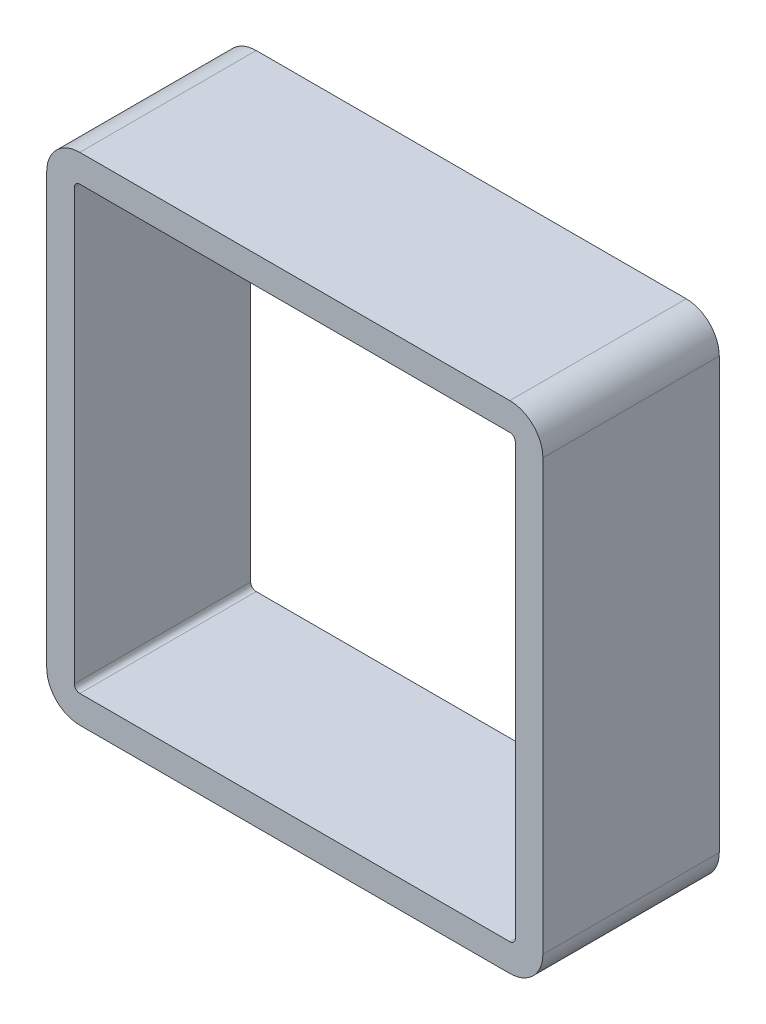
ISO-10303-21;
HEADER;
FILE_DESCRIPTION(('STEP AP214'),'2;1');
FILE_NAME('part.step','',(''),(''),'','','');
FILE_SCHEMA(('AUTOMOTIVE_DESIGN { 1 0 10303 214 1 1 1 1 }'));
ENDSEC;
DATA;
#1=APPLICATION_CONTEXT('core data for automotive mechanical design processes');
#2=APPLICATION_PROTOCOL_DEFINITION('international standard','automotive_design',2000,#1);
#3=PRODUCT_CONTEXT('',#1,'mechanical');
#4=PRODUCT('Part','Part','',(#3));
#5=PRODUCT_RELATED_PRODUCT_CATEGORY('part','',(#4));
#6=PRODUCT_DEFINITION_FORMATION('','',#4);
#7=PRODUCT_DEFINITION_CONTEXT('part definition',#1,'design');
#8=PRODUCT_DEFINITION('design','',#6,#7);
#9=PRODUCT_DEFINITION_SHAPE('','',#8);
#10=(LENGTH_UNIT() NAMED_UNIT(*) SI_UNIT(.MILLI.,.METRE.));
#11=(NAMED_UNIT(*) PLANE_ANGLE_UNIT() SI_UNIT($,.RADIAN.));
#12=(NAMED_UNIT(*) SI_UNIT($,.STERADIAN.) SOLID_ANGLE_UNIT());
#13=UNCERTAINTY_MEASURE_WITH_UNIT(LENGTH_MEASURE(1.E-05),#10,'distance_accuracy_value','');
#14=(GEOMETRIC_REPRESENTATION_CONTEXT(3) GLOBAL_UNCERTAINTY_ASSIGNED_CONTEXT((#13)) GLOBAL_UNIT_ASSIGNED_CONTEXT((#10,
#11,#12)) REPRESENTATION_CONTEXT('',''));
#15=CARTESIAN_POINT('',(0.,0.,0.));
#16=DIRECTION('',(0.,0.,1.));
#17=DIRECTION('',(1.,0.,0.));
#18=AXIS2_PLACEMENT_3D('',#15,#16,#17);
#19=CARTESIAN_POINT('',(17.9625162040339,-9.91931366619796,0.));
#20=DIRECTION('',(0.,0.,1.));
#21=DIRECTION('',(1.,0.,0.));
#22=AXIS2_PLACEMENT_3D('',#19,#20,#21);
#23=CYLINDRICAL_SURFACE('',#22,0.500000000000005);
#24=DIRECTION('',(0.,0.,-1.));
#25=VECTOR('',#24,1.);
#26=CARTESIAN_POINT('',(18.4625162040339,-9.91931366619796,0.));
#27=LINE('',#26,#25);
#28=CARTESIAN_POINT('',(18.4625162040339,-9.91931366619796,16.));
#29=VERTEX_POINT('',#28);
#30=CARTESIAN_POINT('',(18.4625162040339,-9.91931366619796,0.));
#31=VERTEX_POINT('',#30);
#32=EDGE_CURVE('E140',#29,#31,#27,.T.);
#33=ORIENTED_EDGE('',*,*,#32,.T.);
#34=CARTESIAN_POINT('',(17.9625162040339,-9.91931366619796,0.));
#35=DIRECTION('',(0.,0.,1.));
#36=DIRECTION('',(1.,0.,0.));
#37=AXIS2_PLACEMENT_3D('',#34,#35,#36);
#38=CIRCLE('',#37,0.500000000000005);
#39=CARTESIAN_POINT('',(17.9625162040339,-10.419313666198,0.));
#40=VERTEX_POINT('',#39);
#41=EDGE_CURVE('E19',#40,#31,#38,.T.);
#42=ORIENTED_EDGE('',*,*,#41,.F.);
#43=DIRECTION('',(0.,0.,-1.));
#44=VECTOR('',#43,1.);
#45=CARTESIAN_POINT('',(17.9625162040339,-10.419313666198,0.));
#46=LINE('',#45,#44);
#47=CARTESIAN_POINT('',(17.9625162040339,-10.419313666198,16.));
#48=VERTEX_POINT('',#47);
#49=EDGE_CURVE('E180',#40,#48,#46,.F.);
#50=ORIENTED_EDGE('',*,*,#49,.T.);
#51=CARTESIAN_POINT('',(17.9625162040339,-9.91931366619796,16.));
#52=DIRECTION('',(0.,0.,1.));
#53=DIRECTION('',(1.,0.,0.));
#54=AXIS2_PLACEMENT_3D('',#51,#52,#53);
#55=CIRCLE('',#54,0.500000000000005);
#56=EDGE_CURVE('E138',#29,#48,#55,.F.);
#57=ORIENTED_EDGE('',*,*,#56,.F.);
#58=EDGE_LOOP('',(#33,#42,#50,#57));
#59=FACE_BOUND('',#58,.T.);
#60=ADVANCED_FACE('F16',(#59),#23,.F.);
#61=CARTESIAN_POINT('',(-21.0374837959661,-9.91931366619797,0.));
#62=DIRECTION('',(0.,0.,1.));
#63=DIRECTION('',(1.,0.,0.));
#64=AXIS2_PLACEMENT_3D('',#61,#62,#63);
#65=CYLINDRICAL_SURFACE('',#64,0.499999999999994);
#66=DIRECTION('',(0.,0.,-1.));
#67=VECTOR('',#66,1.);
#68=CARTESIAN_POINT('',(-21.0374837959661,-10.419313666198,0.));
#69=LINE('',#68,#67);
#70=CARTESIAN_POINT('',(-21.0374837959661,-10.419313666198,16.));
#71=VERTEX_POINT('',#70);
#72=CARTESIAN_POINT('',(-21.0374837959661,-10.419313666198,0.));
#73=VERTEX_POINT('',#72);
#74=EDGE_CURVE('E144',#71,#73,#69,.T.);
#75=ORIENTED_EDGE('',*,*,#74,.T.);
#76=CARTESIAN_POINT('',(-21.0374837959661,-9.91931366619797,0.));
#77=DIRECTION('',(0.,0.,1.));
#78=DIRECTION('',(1.,0.,0.));
#79=AXIS2_PLACEMENT_3D('',#76,#77,#78);
#80=CIRCLE('',#79,0.499999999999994);
#81=CARTESIAN_POINT('',(-21.5374837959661,-9.91931366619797,0.));
#82=VERTEX_POINT('',#81);
#83=EDGE_CURVE('E230',#82,#73,#80,.T.);
#84=ORIENTED_EDGE('',*,*,#83,.F.);
#85=DIRECTION('',(0.,0.,1.));
#86=VECTOR('',#85,1.);
#87=CARTESIAN_POINT('',(-21.5374837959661,-9.91931366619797,0.));
#88=LINE('',#87,#86);
#89=CARTESIAN_POINT('',(-21.5374837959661,-9.91931366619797,16.));
#90=VERTEX_POINT('',#89);
#91=EDGE_CURVE('E177',#82,#90,#88,.T.);
#92=ORIENTED_EDGE('',*,*,#91,.T.);
#93=CARTESIAN_POINT('',(-21.0374837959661,-9.91931366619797,16.));
#94=DIRECTION('',(0.,0.,1.));
#95=DIRECTION('',(1.,0.,0.));
#96=AXIS2_PLACEMENT_3D('',#93,#94,#95);
#97=CIRCLE('',#96,0.499999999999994);
#98=EDGE_CURVE('E200',#71,#90,#97,.F.);
#99=ORIENTED_EDGE('',*,*,#98,.F.);
#100=EDGE_LOOP('',(#75,#84,#92,#99));
#101=FACE_BOUND('',#100,.T.);
#102=ADVANCED_FACE('F384',(#101),#65,.F.);
#103=CARTESIAN_POINT('',(-21.0374837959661,32.080686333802,0.));
#104=DIRECTION('',(0.,1.,0.));
#105=DIRECTION('',(0.,0.,1.));
#106=AXIS2_PLACEMENT_3D('',#103,#104,#105);
#107=PLANE('',#106);
#108=DIRECTION('',(1.,0.,0.));
#109=VECTOR('',#108,1.);
#110=CARTESIAN_POINT('',(-1.5374837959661,32.080686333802,0.));
#111=LINE('',#110,#109);
#112=CARTESIAN_POINT('',(17.9625162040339,32.080686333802,0.));
#113=VERTEX_POINT('',#112);
#114=CARTESIAN_POINT('',(-21.0374837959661,32.080686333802,0.));
#115=VERTEX_POINT('',#114);
#116=EDGE_CURVE('E157',#113,#115,#111,.F.);
#117=ORIENTED_EDGE('',*,*,#116,.T.);
#118=DIRECTION('',(0.,0.,1.));
#119=VECTOR('',#118,1.);
#120=CARTESIAN_POINT('',(-21.0374837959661,32.080686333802,0.));
#121=LINE('',#120,#119);
#122=CARTESIAN_POINT('',(-21.0374837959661,32.080686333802,16.));
#123=VERTEX_POINT('',#122);
#124=EDGE_CURVE('E198',#123,#115,#121,.F.);
#125=ORIENTED_EDGE('',*,*,#124,.F.);
#126=DIRECTION('',(1.,0.,0.));
#127=VECTOR('',#126,1.);
#128=CARTESIAN_POINT('',(-1.5374837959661,32.080686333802,16.));
#129=LINE('',#128,#127);
#130=CARTESIAN_POINT('',(17.9625162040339,32.080686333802,16.));
#131=VERTEX_POINT('',#130);
#132=EDGE_CURVE('E175',#131,#123,#129,.F.);
#133=ORIENTED_EDGE('',*,*,#132,.F.);
#134=DIRECTION('',(0.,0.,1.));
#135=VECTOR('',#134,1.);
#136=CARTESIAN_POINT('',(17.9625162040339,32.080686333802,0.));
#137=LINE('',#136,#135);
#138=EDGE_CURVE('E145',#113,#131,#137,.T.);
#139=ORIENTED_EDGE('',*,*,#138,.F.);
#140=EDGE_LOOP('',(#117,#125,#133,#139));
#141=FACE_BOUND('',#140,.T.);
#142=ADVANCED_FACE('F376',(#141),#107,.T.);
#143=CARTESIAN_POINT('',(-21.0374837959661,29.080686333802,0.));
#144=DIRECTION('',(0.,0.,1.));
#145=DIRECTION('',(1.,0.,0.));
#146=AXIS2_PLACEMENT_3D('',#143,#144,#145);
#147=CYLINDRICAL_SURFACE('',#146,3.);
#148=CARTESIAN_POINT('',(-21.0374837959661,29.080686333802,0.));
#149=DIRECTION('',(0.,0.,1.));
#150=DIRECTION('',(1.,0.,0.));
#151=AXIS2_PLACEMENT_3D('',#148,#149,#150);
#152=CIRCLE('',#151,3.);
#153=CARTESIAN_POINT('',(-24.0374837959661,29.080686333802,0.));
#154=VERTEX_POINT('',#153);
#155=EDGE_CURVE('E153',#115,#154,#152,.T.);
#156=ORIENTED_EDGE('',*,*,#155,.T.);
#157=DIRECTION('',(0.,0.,1.));
#158=VECTOR('',#157,1.);
#159=CARTESIAN_POINT('',(-24.0374837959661,29.080686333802,0.));
#160=LINE('',#159,#158);
#161=CARTESIAN_POINT('',(-24.0374837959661,29.080686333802,16.));
#162=VERTEX_POINT('',#161);
#163=EDGE_CURVE('E196',#162,#154,#160,.F.);
#164=ORIENTED_EDGE('',*,*,#163,.F.);
#165=CARTESIAN_POINT('',(-21.0374837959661,29.080686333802,16.));
#166=DIRECTION('',(0.,0.,1.));
#167=DIRECTION('',(1.,0.,0.));
#168=AXIS2_PLACEMENT_3D('',#165,#166,#167);
#169=CIRCLE('',#168,3.);
#170=EDGE_CURVE('E218',#123,#162,#169,.T.);
#171=ORIENTED_EDGE('',*,*,#170,.F.);
#172=ORIENTED_EDGE('',*,*,#124,.T.);
#173=EDGE_LOOP('',(#156,#164,#171,#172));
#174=FACE_BOUND('',#173,.T.);
#175=ADVANCED_FACE('F368',(#174),#147,.T.);
#176=CARTESIAN_POINT('',(-24.0374837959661,-9.91931366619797,0.));
#177=DIRECTION('',(-1.,0.,0.));
#178=DIRECTION('',(0.,0.,1.));
#179=AXIS2_PLACEMENT_3D('',#176,#177,#178);
#180=PLANE('',#179);
#181=DIRECTION('',(0.,1.,0.));
#182=VECTOR('',#181,1.);
#183=CARTESIAN_POINT('',(-24.0374837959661,9.58068633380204,0.));
#184=LINE('',#183,#182);
#185=CARTESIAN_POINT('',(-24.0374837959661,-9.91931366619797,0.));
#186=VERTEX_POINT('',#185);
#187=EDGE_CURVE('E169',#154,#186,#184,.F.);
#188=ORIENTED_EDGE('',*,*,#187,.T.);
#189=DIRECTION('',(0.,0.,1.));
#190=VECTOR('',#189,1.);
#191=CARTESIAN_POINT('',(-24.0374837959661,-9.91931366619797,0.));
#192=LINE('',#191,#190);
#193=CARTESIAN_POINT('',(-24.0374837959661,-9.91931366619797,16.));
#194=VERTEX_POINT('',#193);
#195=EDGE_CURVE('E194',#194,#186,#192,.F.);
#196=ORIENTED_EDGE('',*,*,#195,.F.);
#197=DIRECTION('',(0.,1.,0.));
#198=VECTOR('',#197,1.);
#199=CARTESIAN_POINT('',(-24.0374837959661,9.58068633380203,16.));
#200=LINE('',#199,#198);
#201=EDGE_CURVE('E217',#162,#194,#200,.F.);
#202=ORIENTED_EDGE('',*,*,#201,.F.);
#203=ORIENTED_EDGE('',*,*,#163,.T.);
#204=EDGE_LOOP('',(#188,#196,#202,#203));
#205=FACE_BOUND('',#204,.T.);
#206=ADVANCED_FACE('F360',(#205),#180,.T.);
#207=CARTESIAN_POINT('',(-21.0374837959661,-9.91931366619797,0.));
#208=DIRECTION('',(0.,0.,1.));
#209=DIRECTION('',(1.,0.,0.));
#210=AXIS2_PLACEMENT_3D('',#207,#208,#209);
#211=CYLINDRICAL_SURFACE('',#210,3.);
#212=CARTESIAN_POINT('',(-21.0374837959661,-9.91931366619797,0.));
#213=DIRECTION('',(0.,0.,1.));
#214=DIRECTION('',(1.,0.,0.));
#215=AXIS2_PLACEMENT_3D('',#212,#213,#214);
#216=CIRCLE('',#215,3.);
#217=CARTESIAN_POINT('',(-21.0374837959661,-12.919313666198,0.));
#218=VERTEX_POINT('',#217);
#219=EDGE_CURVE('E168',#186,#218,#216,.T.);
#220=ORIENTED_EDGE('',*,*,#219,.T.);
#221=DIRECTION('',(0.,0.,-1.));
#222=VECTOR('',#221,1.);
#223=CARTESIAN_POINT('',(-21.0374837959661,-12.919313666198,0.));
#224=LINE('',#223,#222);
#225=CARTESIAN_POINT('',(-21.0374837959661,-12.919313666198,16.));
#226=VERTEX_POINT('',#225);
#227=EDGE_CURVE('E192',#226,#218,#224,.T.);
#228=ORIENTED_EDGE('',*,*,#227,.F.);
#229=CARTESIAN_POINT('',(-21.0374837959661,-9.91931366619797,16.));
#230=DIRECTION('',(0.,0.,1.));
#231=DIRECTION('',(1.,0.,0.));
#232=AXIS2_PLACEMENT_3D('',#229,#230,#231);
#233=CIRCLE('',#232,3.);
#234=EDGE_CURVE('E215',#194,#226,#233,.T.);
#235=ORIENTED_EDGE('',*,*,#234,.F.);
#236=ORIENTED_EDGE('',*,*,#195,.T.);
#237=EDGE_LOOP('',(#220,#228,#235,#236));
#238=FACE_BOUND('',#237,.T.);
#239=ADVANCED_FACE('F352',(#238),#211,.T.);
#240=CARTESIAN_POINT('',(17.9625162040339,-12.919313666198,0.));
#241=DIRECTION('',(0.,-1.,0.));
#242=DIRECTION('',(0.,0.,-1.));
#243=AXIS2_PLACEMENT_3D('',#240,#241,#242);
#244=PLANE('',#243);
#245=DIRECTION('',(1.,0.,0.));
#246=VECTOR('',#245,1.);
#247=CARTESIAN_POINT('',(-1.5374837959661,-12.919313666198,0.));
#248=LINE('',#247,#246);
#249=CARTESIAN_POINT('',(17.9625162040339,-12.919313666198,0.));
#250=VERTEX_POINT('',#249);
#251=EDGE_CURVE('E165',#218,#250,#248,.T.);
#252=ORIENTED_EDGE('',*,*,#251,.T.);
#253=DIRECTION('',(0.,0.,1.));
#254=VECTOR('',#253,1.);
#255=CARTESIAN_POINT('',(17.9625162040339,-12.919313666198,0.));
#256=LINE('',#255,#254);
#257=CARTESIAN_POINT('',(17.9625162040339,-12.919313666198,16.));
#258=VERTEX_POINT('',#257);
#259=EDGE_CURVE('E190',#258,#250,#256,.F.);
#260=ORIENTED_EDGE('',*,*,#259,.F.);
#261=DIRECTION('',(1.,0.,0.));
#262=VECTOR('',#261,1.);
#263=CARTESIAN_POINT('',(-1.5374837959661,-12.919313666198,16.));
#264=LINE('',#263,#262);
#265=EDGE_CURVE('E214',#226,#258,#264,.T.);
#266=ORIENTED_EDGE('',*,*,#265,.F.);
#267=ORIENTED_EDGE('',*,*,#227,.T.);
#268=EDGE_LOOP('',(#252,#260,#266,#267));
#269=FACE_BOUND('',#268,.T.);
#270=ADVANCED_FACE('F344',(#269),#244,.T.);
#271=CARTESIAN_POINT('',(17.9625162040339,-9.91931366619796,0.));
#272=DIRECTION('',(0.,0.,1.));
#273=DIRECTION('',(1.,0.,0.));
#274=AXIS2_PLACEMENT_3D('',#271,#272,#273);
#275=CYLINDRICAL_SURFACE('',#274,3.);
#276=CARTESIAN_POINT('',(17.9625162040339,-9.91931366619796,0.));
#277=DIRECTION('',(0.,0.,1.));
#278=DIRECTION('',(1.,0.,0.));
#279=AXIS2_PLACEMENT_3D('',#276,#277,#278);
#280=CIRCLE('',#279,3.);
#281=CARTESIAN_POINT('',(20.9625162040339,-9.91931366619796,0.));
#282=VERTEX_POINT('',#281);
#283=EDGE_CURVE('E164',#250,#282,#280,.T.);
#284=ORIENTED_EDGE('',*,*,#283,.T.);
#285=DIRECTION('',(0.,0.,-1.));
#286=VECTOR('',#285,1.);
#287=CARTESIAN_POINT('',(20.9625162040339,-9.91931366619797,0.));
#288=LINE('',#287,#286);
#289=CARTESIAN_POINT('',(20.9625162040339,-9.91931366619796,16.));
#290=VERTEX_POINT('',#289);
#291=EDGE_CURVE('E188',#290,#282,#288,.T.);
#292=ORIENTED_EDGE('',*,*,#291,.F.);
#293=CARTESIAN_POINT('',(17.9625162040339,-9.91931366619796,16.));
#294=DIRECTION('',(0.,0.,1.));
#295=DIRECTION('',(1.,0.,0.));
#296=AXIS2_PLACEMENT_3D('',#293,#294,#295);
#297=CIRCLE('',#296,3.);
#298=EDGE_CURVE('E212',#258,#290,#297,.T.);
#299=ORIENTED_EDGE('',*,*,#298,.F.);
#300=ORIENTED_EDGE('',*,*,#259,.T.);
#301=EDGE_LOOP('',(#284,#292,#299,#300));
#302=FACE_BOUND('',#301,.T.);
#303=ADVANCED_FACE('F336',(#302),#275,.T.);
#304=CARTESIAN_POINT('',(20.9625162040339,29.080686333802,0.));
#305=DIRECTION('',(1.,0.,0.));
#306=DIRECTION('',(0.,0.,-1.));
#307=AXIS2_PLACEMENT_3D('',#304,#305,#306);
#308=PLANE('',#307);
#309=DIRECTION('',(0.,1.,0.));
#310=VECTOR('',#309,1.);
#311=CARTESIAN_POINT('',(20.9625162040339,9.58068633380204,0.));
#312=LINE('',#311,#310);
#313=CARTESIAN_POINT('',(20.9625162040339,29.080686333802,0.));
#314=VERTEX_POINT('',#313);
#315=EDGE_CURVE('E161',#282,#314,#312,.T.);
#316=ORIENTED_EDGE('',*,*,#315,.T.);
#317=DIRECTION('',(0.,0.,1.));
#318=VECTOR('',#317,1.);
#319=CARTESIAN_POINT('',(20.9625162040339,29.080686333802,0.));
#320=LINE('',#319,#318);
#321=CARTESIAN_POINT('',(20.9625162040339,29.080686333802,16.));
#322=VERTEX_POINT('',#321);
#323=EDGE_CURVE('E186',#322,#314,#320,.F.);
#324=ORIENTED_EDGE('',*,*,#323,.F.);
#325=DIRECTION('',(0.,1.,0.));
#326=VECTOR('',#325,1.);
#327=CARTESIAN_POINT('',(20.9625162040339,9.58068633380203,16.));
#328=LINE('',#327,#326);
#329=EDGE_CURVE('E211',#290,#322,#328,.T.);
#330=ORIENTED_EDGE('',*,*,#329,.F.);
#331=ORIENTED_EDGE('',*,*,#291,.T.);
#332=EDGE_LOOP('',(#316,#324,#330,#331));
#333=FACE_BOUND('',#332,.T.);
#334=ADVANCED_FACE('F328',(#333),#308,.T.);
#335=CARTESIAN_POINT('',(17.9625162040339,29.080686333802,0.));
#336=DIRECTION('',(0.,0.,1.));
#337=DIRECTION('',(1.,0.,0.));
#338=AXIS2_PLACEMENT_3D('',#335,#336,#337);
#339=CYLINDRICAL_SURFACE('',#338,3.);
#340=CARTESIAN_POINT('',(17.9625162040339,29.080686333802,0.));
#341=DIRECTION('',(0.,0.,1.));
#342=DIRECTION('',(1.,0.,0.));
#343=AXIS2_PLACEMENT_3D('',#340,#341,#342);
#344=CIRCLE('',#343,3.);
#345=EDGE_CURVE('E160',#314,#113,#344,.T.);
#346=ORIENTED_EDGE('',*,*,#345,.T.);
#347=ORIENTED_EDGE('',*,*,#138,.T.);
#348=CARTESIAN_POINT('',(17.9625162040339,29.080686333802,16.));
#349=DIRECTION('',(0.,0.,1.));
#350=DIRECTION('',(1.,0.,0.));
#351=AXIS2_PLACEMENT_3D('',#348,#349,#350);
#352=CIRCLE('',#351,3.);
#353=EDGE_CURVE('E208',#322,#131,#352,.T.);
#354=ORIENTED_EDGE('',*,*,#353,.F.);
#355=ORIENTED_EDGE('',*,*,#323,.T.);
#356=EDGE_LOOP('',(#346,#347,#354,#355));
#357=FACE_BOUND('',#356,.T.);
#358=ADVANCED_FACE('F321',(#357),#339,.T.);
#359=CARTESIAN_POINT('',(18.4625162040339,29.080686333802,0.));
#360=DIRECTION('',(1.,0.,0.));
#361=DIRECTION('',(0.,0.,-1.));
#362=AXIS2_PLACEMENT_3D('',#359,#360,#361);
#363=PLANE('',#362);
#364=DIRECTION('',(0.,0.,1.));
#365=VECTOR('',#364,1.);
#366=CARTESIAN_POINT('',(18.4625162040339,29.080686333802,0.));
#367=LINE('',#366,#365);
#368=CARTESIAN_POINT('',(18.4625162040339,29.080686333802,16.));
#369=VERTEX_POINT('',#368);
#370=CARTESIAN_POINT('',(18.4625162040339,29.080686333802,0.));
#371=VERTEX_POINT('',#370);
#372=EDGE_CURVE('E148',#369,#371,#367,.F.);
#373=ORIENTED_EDGE('',*,*,#372,.T.);
#374=DIRECTION('',(0.,1.,0.));
#375=VECTOR('',#374,1.);
#376=CARTESIAN_POINT('',(18.4625162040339,9.58068633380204,0.));
#377=LINE('',#376,#375);
#378=EDGE_CURVE('E134',#371,#31,#377,.F.);
#379=ORIENTED_EDGE('',*,*,#378,.T.);
#380=ORIENTED_EDGE('',*,*,#32,.F.);
#381=DIRECTION('',(0.,1.,0.));
#382=VECTOR('',#381,1.);
#383=CARTESIAN_POINT('',(18.4625162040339,9.58068633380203,16.));
#384=LINE('',#383,#382);
#385=EDGE_CURVE('E207',#369,#29,#384,.F.);
#386=ORIENTED_EDGE('',*,*,#385,.F.);
#387=EDGE_LOOP('',(#373,#379,#380,#386));
#388=FACE_BOUND('',#387,.T.);
#389=ADVANCED_FACE('F147',(#388),#363,.F.);
#390=CARTESIAN_POINT('',(17.9625162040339,-10.419313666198,0.));
#391=DIRECTION('',(0.,-1.,0.));
#392=DIRECTION('',(0.,0.,-1.));
#393=AXIS2_PLACEMENT_3D('',#390,#391,#392);
#394=PLANE('',#393);
#395=ORIENTED_EDGE('',*,*,#49,.F.);
#396=DIRECTION('',(1.,0.,0.));
#397=VECTOR('',#396,1.);
#398=CARTESIAN_POINT('',(-1.5374837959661,-10.419313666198,0.));
#399=LINE('',#398,#397);
#400=EDGE_CURVE('E137',#40,#73,#399,.F.);
#401=ORIENTED_EDGE('',*,*,#400,.T.);
#402=ORIENTED_EDGE('',*,*,#74,.F.);
#403=DIRECTION('',(1.,0.,0.));
#404=VECTOR('',#403,1.);
#405=CARTESIAN_POINT('',(-1.5374837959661,-10.419313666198,16.));
#406=LINE('',#405,#404);
#407=EDGE_CURVE('E235',#48,#71,#406,.F.);
#408=ORIENTED_EDGE('',*,*,#407,.F.);
#409=EDGE_LOOP('',(#395,#401,#402,#408));
#410=FACE_BOUND('',#409,.T.);
#411=ADVANCED_FACE('F238',(#410),#394,.F.);
#412=CARTESIAN_POINT('',(-21.5374837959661,-9.91931366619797,0.));
#413=DIRECTION('',(-1.,0.,0.));
#414=DIRECTION('',(0.,0.,1.));
#415=AXIS2_PLACEMENT_3D('',#412,#413,#414);
#416=PLANE('',#415);
#417=ORIENTED_EDGE('',*,*,#91,.F.);
#418=DIRECTION('',(0.,1.,0.));
#419=VECTOR('',#418,1.);
#420=CARTESIAN_POINT('',(-21.5374837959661,9.58068633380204,0.));
#421=LINE('',#420,#419);
#422=CARTESIAN_POINT('',(-21.5374837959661,29.080686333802,0.));
#423=VERTEX_POINT('',#422);
#424=EDGE_CURVE('E151',#82,#423,#421,.T.);
#425=ORIENTED_EDGE('',*,*,#424,.T.);
#426=DIRECTION('',(0.,0.,1.));
#427=VECTOR('',#426,1.);
#428=CARTESIAN_POINT('',(-21.5374837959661,29.080686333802,0.));
#429=LINE('',#428,#427);
#430=CARTESIAN_POINT('',(-21.5374837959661,29.080686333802,16.));
#431=VERTEX_POINT('',#430);
#432=EDGE_CURVE('E172',#423,#431,#429,.T.);
#433=ORIENTED_EDGE('',*,*,#432,.T.);
#434=DIRECTION('',(0.,1.,0.));
#435=VECTOR('',#434,1.);
#436=CARTESIAN_POINT('',(-21.5374837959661,9.58068633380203,16.));
#437=LINE('',#436,#435);
#438=EDGE_CURVE('E203',#90,#431,#437,.T.);
#439=ORIENTED_EDGE('',*,*,#438,.F.);
#440=EDGE_LOOP('',(#417,#425,#433,#439));
#441=FACE_BOUND('',#440,.T.);
#442=ADVANCED_FACE('F257',(#441),#416,.F.);
#443=CARTESIAN_POINT('',(17.9625162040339,29.080686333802,0.));
#444=DIRECTION('',(0.,0.,1.));
#445=DIRECTION('',(1.,0.,0.));
#446=AXIS2_PLACEMENT_3D('',#443,#444,#445);
#447=CYLINDRICAL_SURFACE('',#446,0.499999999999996);
#448=DIRECTION('',(0.,0.,1.));
#449=VECTOR('',#448,1.);
#450=CARTESIAN_POINT('',(17.9625162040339,29.580686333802,0.));
#451=LINE('',#450,#449);
#452=CARTESIAN_POINT('',(17.9625162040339,29.580686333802,16.));
#453=VERTEX_POINT('',#452);
#454=CARTESIAN_POINT('',(17.9625162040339,29.580686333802,0.));
#455=VERTEX_POINT('',#454);
#456=EDGE_CURVE('E202',#453,#455,#451,.F.);
#457=ORIENTED_EDGE('',*,*,#456,.T.);
#458=CARTESIAN_POINT('',(17.9625162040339,29.080686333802,0.));
#459=DIRECTION('',(0.,0.,1.));
#460=DIRECTION('',(1.,0.,0.));
#461=AXIS2_PLACEMENT_3D('',#458,#459,#460);
#462=CIRCLE('',#461,0.499999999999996);
#463=EDGE_CURVE('E149',#455,#371,#462,.F.);
#464=ORIENTED_EDGE('',*,*,#463,.T.);
#465=ORIENTED_EDGE('',*,*,#372,.F.);
#466=CARTESIAN_POINT('',(17.9625162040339,29.080686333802,16.));
#467=DIRECTION('',(0.,0.,1.));
#468=DIRECTION('',(1.,0.,0.));
#469=AXIS2_PLACEMENT_3D('',#466,#467,#468);
#470=CIRCLE('',#469,0.499999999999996);
#471=EDGE_CURVE('E204',#453,#369,#470,.F.);
#472=ORIENTED_EDGE('',*,*,#471,.F.);
#473=EDGE_LOOP('',(#457,#464,#465,#472));
#474=FACE_BOUND('',#473,.T.);
#475=ADVANCED_FACE('F267',(#474),#447,.F.);
#476=CARTESIAN_POINT('',(-1.5374837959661,9.58068633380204,0.));
#477=DIRECTION('',(0.,0.,1.));
#478=DIRECTION('',(1.,0.,0.));
#479=AXIS2_PLACEMENT_3D('',#476,#477,#478);
#480=PLANE('',#479);
#481=CARTESIAN_POINT('',(-21.0374837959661,29.080686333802,0.));
#482=DIRECTION('',(0.,0.,1.));
#483=DIRECTION('',(1.,0.,0.));
#484=AXIS2_PLACEMENT_3D('',#481,#482,#483);
#485=CIRCLE('',#484,0.499999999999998);
#486=CARTESIAN_POINT('',(-21.0374837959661,29.580686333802,0.));
#487=VERTEX_POINT('',#486);
#488=EDGE_CURVE('E176',#487,#423,#485,.T.);
#489=ORIENTED_EDGE('',*,*,#488,.T.);
#490=ORIENTED_EDGE('',*,*,#424,.F.);
#491=ORIENTED_EDGE('',*,*,#83,.T.);
#492=ORIENTED_EDGE('',*,*,#400,.F.);
#493=ORIENTED_EDGE('',*,*,#41,.T.);
#494=ORIENTED_EDGE('',*,*,#378,.F.);
#495=ORIENTED_EDGE('',*,*,#463,.F.);
#496=DIRECTION('',(1.,0.,0.));
#497=VECTOR('',#496,1.);
#498=CARTESIAN_POINT('',(-21.0374837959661,29.580686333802,0.));
#499=LINE('',#498,#497);
#500=EDGE_CURVE('E248',#455,#487,#499,.F.);
#501=ORIENTED_EDGE('',*,*,#500,.T.);
#502=EDGE_LOOP('',(#489,#490,#491,#492,#493,#494,#495,#501));
#503=FACE_BOUND('',#502,.T.);
#504=ORIENTED_EDGE('',*,*,#116,.F.);
#505=ORIENTED_EDGE('',*,*,#345,.F.);
#506=ORIENTED_EDGE('',*,*,#315,.F.);
#507=ORIENTED_EDGE('',*,*,#283,.F.);
#508=ORIENTED_EDGE('',*,*,#251,.F.);
#509=ORIENTED_EDGE('',*,*,#219,.F.);
#510=ORIENTED_EDGE('',*,*,#187,.F.);
#511=ORIENTED_EDGE('',*,*,#155,.F.);
#512=EDGE_LOOP('',(#504,#505,#506,#507,#508,#509,#510,#511));
#513=FACE_BOUND('',#512,.T.);
#514=ADVANCED_FACE('F131',(#503,#513),#480,.F.);
#515=CARTESIAN_POINT('',(-21.0374837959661,29.080686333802,0.));
#516=DIRECTION('',(0.,0.,1.));
#517=DIRECTION('',(1.,0.,0.));
#518=AXIS2_PLACEMENT_3D('',#515,#516,#517);
#519=CYLINDRICAL_SURFACE('',#518,0.499999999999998);
#520=ORIENTED_EDGE('',*,*,#432,.F.);
#521=ORIENTED_EDGE('',*,*,#488,.F.);
#522=DIRECTION('',(0.,0.,1.));
#523=VECTOR('',#522,1.);
#524=CARTESIAN_POINT('',(-21.0374837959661,29.580686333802,0.));
#525=LINE('',#524,#523);
#526=CARTESIAN_POINT('',(-21.0374837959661,29.580686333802,16.));
#527=VERTEX_POINT('',#526);
#528=EDGE_CURVE('E25',#487,#527,#525,.T.);
#529=ORIENTED_EDGE('',*,*,#528,.T.);
#530=CARTESIAN_POINT('',(-21.0374837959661,29.080686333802,16.));
#531=DIRECTION('',(0.,0.,1.));
#532=DIRECTION('',(1.,0.,0.));
#533=AXIS2_PLACEMENT_3D('',#530,#531,#532);
#534=CIRCLE('',#533,0.499999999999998);
#535=EDGE_CURVE('E33',#431,#527,#534,.F.);
#536=ORIENTED_EDGE('',*,*,#535,.F.);
#537=EDGE_LOOP('',(#520,#521,#529,#536));
#538=FACE_BOUND('',#537,.T.);
#539=ADVANCED_FACE('F260',(#538),#519,.F.);
#540=CARTESIAN_POINT('',(-1.5374837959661,9.58068633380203,16.));
#541=DIRECTION('',(0.,0.,1.));
#542=DIRECTION('',(1.,0.,0.));
#543=AXIS2_PLACEMENT_3D('',#540,#541,#542);
#544=PLANE('',#543);
#545=ORIENTED_EDGE('',*,*,#438,.T.);
#546=ORIENTED_EDGE('',*,*,#535,.T.);
#547=DIRECTION('',(1.,0.,0.));
#548=VECTOR('',#547,1.);
#549=CARTESIAN_POINT('',(-21.0374837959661,29.580686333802,16.));
#550=LINE('',#549,#548);
#551=EDGE_CURVE('E11',#527,#453,#550,.T.);
#552=ORIENTED_EDGE('',*,*,#551,.T.);
#553=ORIENTED_EDGE('',*,*,#471,.T.);
#554=ORIENTED_EDGE('',*,*,#385,.T.);
#555=ORIENTED_EDGE('',*,*,#56,.T.);
#556=ORIENTED_EDGE('',*,*,#407,.T.);
#557=ORIENTED_EDGE('',*,*,#98,.T.);
#558=EDGE_LOOP('',(#545,#546,#552,#553,#554,#555,#556,#557));
#559=FACE_BOUND('',#558,.T.);
#560=ORIENTED_EDGE('',*,*,#329,.T.);
#561=ORIENTED_EDGE('',*,*,#353,.T.);
#562=ORIENTED_EDGE('',*,*,#132,.T.);
#563=ORIENTED_EDGE('',*,*,#170,.T.);
#564=ORIENTED_EDGE('',*,*,#201,.T.);
#565=ORIENTED_EDGE('',*,*,#234,.T.);
#566=ORIENTED_EDGE('',*,*,#265,.T.);
#567=ORIENTED_EDGE('',*,*,#298,.T.);
#568=EDGE_LOOP('',(#560,#561,#562,#563,#564,#565,#566,#567));
#569=FACE_BOUND('',#568,.T.);
#570=ADVANCED_FACE('F232',(#559,#569),#544,.T.);
#571=CARTESIAN_POINT('',(-21.0374837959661,29.580686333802,0.));
#572=DIRECTION('',(0.,1.,0.));
#573=DIRECTION('',(0.,0.,1.));
#574=AXIS2_PLACEMENT_3D('',#571,#572,#573);
#575=PLANE('',#574);
#576=ORIENTED_EDGE('',*,*,#528,.F.);
#577=ORIENTED_EDGE('',*,*,#500,.F.);
#578=ORIENTED_EDGE('',*,*,#456,.F.);
#579=ORIENTED_EDGE('',*,*,#551,.F.);
#580=EDGE_LOOP('',(#576,#577,#578,#579));
#581=FACE_BOUND('',#580,.T.);
#582=ADVANCED_FACE('F264',(#581),#575,.F.);
#583=CLOSED_SHELL('',(#60,#102,#142,#175,#206,#239,#270,#303,#334,#358,#389,#411,#442,#475,#514,
#539,#570,#582));
#584=MANIFOLD_SOLID_BREP('B1',#583);
#585=ADVANCED_BREP_SHAPE_REPRESENTATION('',(#18,#584),#14);
#586=SHAPE_DEFINITION_REPRESENTATION(#9,#585);
ENDSEC;
END-ISO-10303-21;
